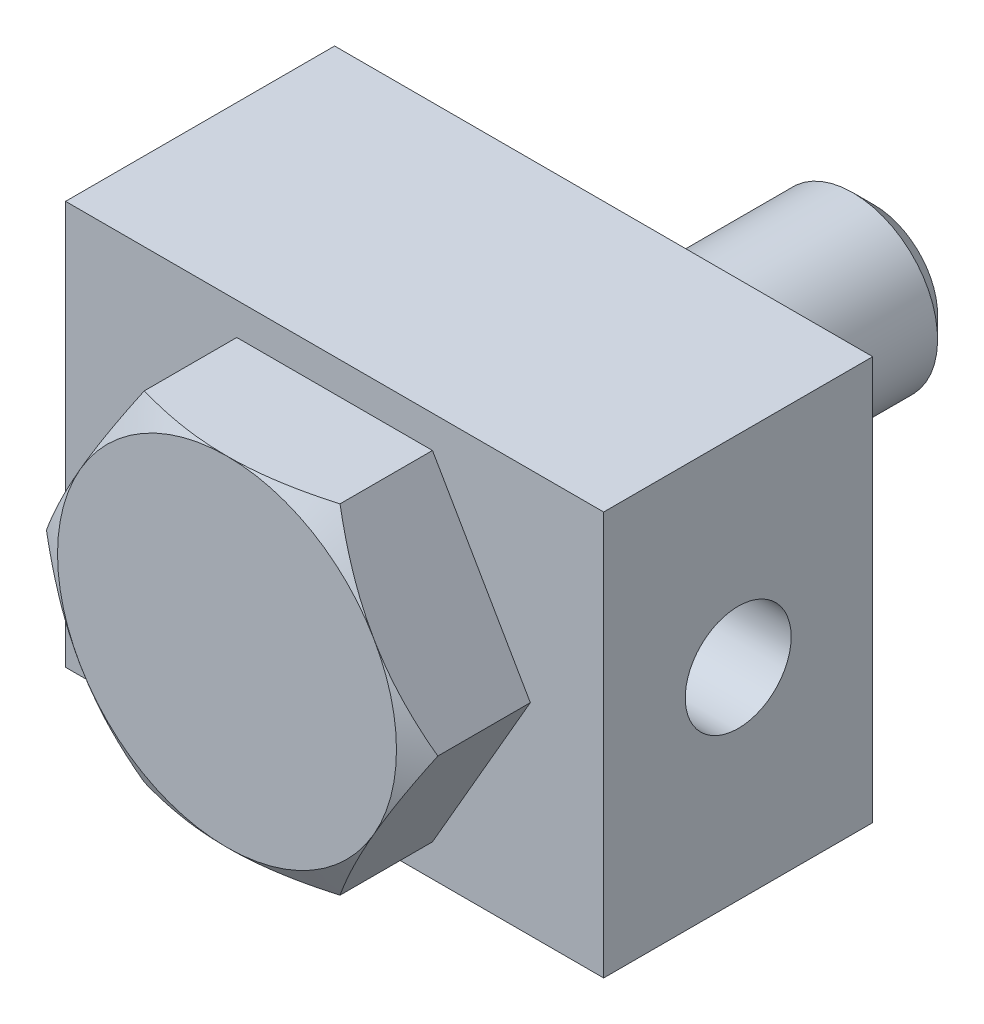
ISO-10303-21;
HEADER;
FILE_DESCRIPTION(('STEP AP214'),'2;1');
FILE_NAME('part.step','',(''),(''),'','','');
FILE_SCHEMA(('AUTOMOTIVE_DESIGN { 1 0 10303 214 1 1 1 1 }'));
ENDSEC;
DATA;
#1=APPLICATION_CONTEXT('core data for automotive mechanical design processes');
#2=APPLICATION_PROTOCOL_DEFINITION('international standard','automotive_design',2000,#1);
#3=PRODUCT_CONTEXT('',#1,'mechanical');
#4=PRODUCT('Part','Part','',(#3));
#5=PRODUCT_RELATED_PRODUCT_CATEGORY('part','',(#4));
#6=PRODUCT_DEFINITION_FORMATION('','',#4);
#7=PRODUCT_DEFINITION_CONTEXT('part definition',#1,'design');
#8=PRODUCT_DEFINITION('design','',#6,#7);
#9=PRODUCT_DEFINITION_SHAPE('','',#8);
#10=(LENGTH_UNIT() NAMED_UNIT(*) SI_UNIT(.MILLI.,.METRE.));
#11=(NAMED_UNIT(*) PLANE_ANGLE_UNIT() SI_UNIT($,.RADIAN.));
#12=(NAMED_UNIT(*) SI_UNIT($,.STERADIAN.) SOLID_ANGLE_UNIT());
#13=UNCERTAINTY_MEASURE_WITH_UNIT(LENGTH_MEASURE(1.E-05),#10,'distance_accuracy_value','');
#14=(GEOMETRIC_REPRESENTATION_CONTEXT(3) GLOBAL_UNCERTAINTY_ASSIGNED_CONTEXT((#13)) GLOBAL_UNIT_ASSIGNED_CONTEXT((#10,
#11,#12)) REPRESENTATION_CONTEXT('',''));
#15=CARTESIAN_POINT('',(0.,0.,0.));
#16=DIRECTION('',(0.,0.,1.));
#17=DIRECTION('',(1.,0.,0.));
#18=AXIS2_PLACEMENT_3D('',#15,#16,#17);
#19=CARTESIAN_POINT('',(25.4,-19.05,26.924));
#20=DIRECTION('',(0.,0.,1.));
#21=DIRECTION('',(0.,1.,0.));
#22=AXIS2_PLACEMENT_3D('',#19,#20,#21);
#23=PLANE('',#22);
#24=DIRECTION('',(0.,-1.,0.));
#25=VECTOR('',#24,1.);
#26=CARTESIAN_POINT('',(-25.4,0.,26.924));
#27=LINE('',#26,#25);
#28=CARTESIAN_POINT('',(-25.4,19.05,26.924));
#29=VERTEX_POINT('',#28);
#30=CARTESIAN_POINT('',(-25.4,-19.05,26.924));
#31=VERTEX_POINT('',#30);
#32=EDGE_CURVE('E295',#29,#31,#27,.T.);
#33=ORIENTED_EDGE('',*,*,#32,.T.);
#34=DIRECTION('',(1.,0.,0.));
#35=VECTOR('',#34,1.);
#36=CARTESIAN_POINT('',(0.,-19.05,26.924));
#37=LINE('',#36,#35);
#38=CARTESIAN_POINT('',(25.4,-19.05,26.924));
#39=VERTEX_POINT('',#38);
#40=EDGE_CURVE('E290',#31,#39,#37,.T.);
#41=ORIENTED_EDGE('',*,*,#40,.T.);
#42=DIRECTION('',(0.,1.,0.));
#43=VECTOR('',#42,1.);
#44=CARTESIAN_POINT('',(25.4,0.,26.924));
#45=LINE('',#44,#43);
#46=CARTESIAN_POINT('',(25.4,19.05,26.924));
#47=VERTEX_POINT('',#46);
#48=EDGE_CURVE('E275',#39,#47,#45,.T.);
#49=ORIENTED_EDGE('',*,*,#48,.T.);
#50=DIRECTION('',(-1.,0.,0.));
#51=VECTOR('',#50,1.);
#52=CARTESIAN_POINT('',(0.,19.05,26.924));
#53=LINE('',#52,#51);
#54=EDGE_CURVE('E300',#47,#29,#53,.T.);
#55=ORIENTED_EDGE('',*,*,#54,.T.);
#56=EDGE_LOOP('',(#33,#41,#49,#55));
#57=FACE_BOUND('',#56,.T.);
#58=DIRECTION('',(-0.5,-0.866025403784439,0.));
#59=VECTOR('',#58,1.);
#60=CARTESIAN_POINT('',(-9.23760430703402,16.,26.924));
#61=LINE('',#60,#59);
#62=CARTESIAN_POINT('',(-9.23760430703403,16.,26.924));
#63=VERTEX_POINT('',#62);
#64=CARTESIAN_POINT('',(-18.475208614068,0.,26.924));
#65=VERTEX_POINT('',#64);
#66=EDGE_CURVE('E495',#63,#65,#61,.T.);
#67=ORIENTED_EDGE('',*,*,#66,.F.);
#68=DIRECTION('',(-1.,0.,0.));
#69=VECTOR('',#68,1.);
#70=CARTESIAN_POINT('',(9.23760430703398,16.,26.924));
#71=LINE('',#70,#69);
#72=CARTESIAN_POINT('',(9.23760430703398,16.,26.924));
#73=VERTEX_POINT('',#72);
#74=EDGE_CURVE('E482',#73,#63,#71,.T.);
#75=ORIENTED_EDGE('',*,*,#74,.F.);
#76=DIRECTION('',(-0.5,0.866025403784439,0.));
#77=VECTOR('',#76,1.);
#78=CARTESIAN_POINT('',(18.475208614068,0.,26.924));
#79=LINE('',#78,#77);
#80=CARTESIAN_POINT('',(18.475208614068,0.,26.924));
#81=VERTEX_POINT('',#80);
#82=EDGE_CURVE('E485',#81,#73,#79,.T.);
#83=ORIENTED_EDGE('',*,*,#82,.F.);
#84=DIRECTION('',(0.5,0.866025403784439,0.));
#85=VECTOR('',#84,1.);
#86=CARTESIAN_POINT('',(9.23760430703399,-16.,26.924));
#87=LINE('',#86,#85);
#88=CARTESIAN_POINT('',(9.23760430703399,-16.,26.924));
#89=VERTEX_POINT('',#88);
#90=EDGE_CURVE('E487',#89,#81,#87,.T.);
#91=ORIENTED_EDGE('',*,*,#90,.F.);
#92=DIRECTION('',(1.,0.,0.));
#93=VECTOR('',#92,1.);
#94=CARTESIAN_POINT('',(-9.23760430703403,-16.,26.924));
#95=LINE('',#94,#93);
#96=CARTESIAN_POINT('',(-9.23760430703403,-16.,26.924));
#97=VERTEX_POINT('',#96);
#98=EDGE_CURVE('E490',#97,#89,#95,.T.);
#99=ORIENTED_EDGE('',*,*,#98,.F.);
#100=DIRECTION('',(0.5,-0.866025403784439,0.));
#101=VECTOR('',#100,1.);
#102=CARTESIAN_POINT('',(-18.475208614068,0.,26.924));
#103=LINE('',#102,#101);
#104=EDGE_CURVE('E493',#65,#97,#103,.T.);
#105=ORIENTED_EDGE('',*,*,#104,.F.);
#106=EDGE_LOOP('',(#67,#75,#83,#91,#99,#105));
#107=FACE_BOUND('',#106,.T.);
#108=ADVANCED_FACE('F14',(#57,#107),#23,.T.);
#109=CARTESIAN_POINT('',(12.788138,-12.788138,0.));
#110=DIRECTION('',(0.,0.,1.));
#111=DIRECTION('',(0.,1.,0.));
#112=AXIS2_PLACEMENT_3D('',#109,#110,#111);
#113=PLANE('',#112);
#114=CARTESIAN_POINT('',(0.,0.,0.));
#115=DIRECTION('',(0.,0.,1.));
#116=DIRECTION('',(1.,0.,0.));
#117=AXIS2_PLACEMENT_3D('',#114,#115,#116);
#118=CIRCLE('',#117,12.6365);
#119=CARTESIAN_POINT('',(12.6365,0.,0.));
#120=VERTEX_POINT('',#119);
#121=EDGE_CURVE('E135',#120,#120,#118,.T.);
#122=ORIENTED_EDGE('',*,*,#121,.F.);
#123=EDGE_LOOP('',(#122));
#124=FACE_BOUND('',#123,.T.);
#125=CARTESIAN_POINT('',(0.,0.,0.));
#126=DIRECTION('',(0.,0.,-1.));
#127=DIRECTION('',(0.,1.,0.));
#128=AXIS2_PLACEMENT_3D('',#125,#126,#127);
#129=CIRCLE('',#128,8.000000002);
#130=CARTESIAN_POINT('',(0.,8.000000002,0.));
#131=VERTEX_POINT('',#130);
#132=EDGE_CURVE('E129',#131,#131,#129,.T.);
#133=ORIENTED_EDGE('',*,*,#132,.F.);
#134=EDGE_LOOP('',(#133));
#135=FACE_BOUND('',#134,.T.);
#136=ADVANCED_FACE('F223',(#124,#135),#113,.F.);
#137=CARTESIAN_POINT('',(0.,0.,0.));
#138=DIRECTION('',(0.,0.,1.));
#139=DIRECTION('',(1.,0.,0.));
#140=AXIS2_PLACEMENT_3D('',#137,#138,#139);
#141=CYLINDRICAL_SURFACE('',#140,12.6365);
#142=CARTESIAN_POINT('',(0.,0.,1.524));
#143=DIRECTION('',(0.,0.,1.));
#144=DIRECTION('',(1.,0.,0.));
#145=AXIS2_PLACEMENT_3D('',#142,#143,#144);
#146=CIRCLE('',#145,12.6365);
#147=CARTESIAN_POINT('',(12.6365,0.,1.524));
#148=VERTEX_POINT('',#147);
#149=EDGE_CURVE('E304',#148,#148,#146,.T.);
#150=ORIENTED_EDGE('',*,*,#149,.F.);
#151=EDGE_LOOP('',(#150));
#152=FACE_BOUND('',#151,.T.);
#153=ORIENTED_EDGE('',*,*,#121,.T.);
#154=EDGE_LOOP('',(#153));
#155=FACE_BOUND('',#154,.T.);
#156=ADVANCED_FACE('F219',(#152,#155),#141,.T.);
#157=CARTESIAN_POINT('',(25.4,-19.05,1.524));
#158=DIRECTION('',(0.,0.,1.));
#159=DIRECTION('',(0.,1.,0.));
#160=AXIS2_PLACEMENT_3D('',#157,#158,#159);
#161=PLANE('',#160);
#162=ORIENTED_EDGE('',*,*,#149,.T.);
#163=EDGE_LOOP('',(#162));
#164=FACE_BOUND('',#163,.T.);
#165=DIRECTION('',(1.,0.,0.));
#166=VECTOR('',#165,1.);
#167=CARTESIAN_POINT('',(0.,-19.05,1.524));
#168=LINE('',#167,#166);
#169=CARTESIAN_POINT('',(-25.4,-19.05,1.524));
#170=VERTEX_POINT('',#169);
#171=CARTESIAN_POINT('',(25.4,-19.05,1.524));
#172=VERTEX_POINT('',#171);
#173=EDGE_CURVE('E468',#170,#172,#168,.T.);
#174=ORIENTED_EDGE('',*,*,#173,.F.);
#175=DIRECTION('',(0.,-1.,0.));
#176=VECTOR('',#175,1.);
#177=CARTESIAN_POINT('',(-25.4,0.,1.524));
#178=LINE('',#177,#176);
#179=CARTESIAN_POINT('',(-25.4,19.05,1.524));
#180=VERTEX_POINT('',#179);
#181=EDGE_CURVE('E282',#180,#170,#178,.T.);
#182=ORIENTED_EDGE('',*,*,#181,.F.);
#183=DIRECTION('',(-1.,0.,0.));
#184=VECTOR('',#183,1.);
#185=CARTESIAN_POINT('',(0.,19.05,1.524));
#186=LINE('',#185,#184);
#187=CARTESIAN_POINT('',(25.4,19.05,1.524));
#188=VERTEX_POINT('',#187);
#189=EDGE_CURVE('E280',#188,#180,#186,.T.);
#190=ORIENTED_EDGE('',*,*,#189,.F.);
#191=DIRECTION('',(0.,1.,0.));
#192=VECTOR('',#191,1.);
#193=CARTESIAN_POINT('',(25.4,0.,1.524));
#194=LINE('',#193,#192);
#195=EDGE_CURVE('E277',#172,#188,#194,.T.);
#196=ORIENTED_EDGE('',*,*,#195,.F.);
#197=EDGE_LOOP('',(#174,#182,#190,#196));
#198=FACE_BOUND('',#197,.T.);
#199=ADVANCED_FACE('F222',(#164,#198),#161,.F.);
#200=CARTESIAN_POINT('',(25.4,-19.05,1.524));
#201=DIRECTION('',(0.,1.,0.));
#202=DIRECTION('',(-1.,0.,0.));
#203=AXIS2_PLACEMENT_3D('',#200,#201,#202);
#204=PLANE('',#203);
#205=DIRECTION('',(0.,0.,1.));
#206=VECTOR('',#205,1.);
#207=CARTESIAN_POINT('',(25.4,-19.05,14.224));
#208=LINE('',#207,#206);
#209=EDGE_CURVE('E284',#172,#39,#208,.T.);
#210=ORIENTED_EDGE('',*,*,#209,.T.);
#211=ORIENTED_EDGE('',*,*,#40,.F.);
#212=DIRECTION('',(0.,0.,1.));
#213=VECTOR('',#212,1.);
#214=CARTESIAN_POINT('',(-25.4,-19.05,14.224));
#215=LINE('',#214,#213);
#216=EDGE_CURVE('E292',#170,#31,#215,.T.);
#217=ORIENTED_EDGE('',*,*,#216,.F.);
#218=ORIENTED_EDGE('',*,*,#173,.T.);
#219=EDGE_LOOP('',(#210,#211,#217,#218));
#220=FACE_BOUND('',#219,.T.);
#221=ADVANCED_FACE('F234',(#220),#204,.F.);
#222=CARTESIAN_POINT('',(-25.4,19.05,1.524));
#223=DIRECTION('',(0.,-1.,0.));
#224=DIRECTION('',(1.,0.,0.));
#225=AXIS2_PLACEMENT_3D('',#222,#223,#224);
#226=PLANE('',#225);
#227=DIRECTION('',(0.,0.,1.));
#228=VECTOR('',#227,1.);
#229=CARTESIAN_POINT('',(-25.4,19.05,14.224));
#230=LINE('',#229,#228);
#231=EDGE_CURVE('E297',#180,#29,#230,.T.);
#232=ORIENTED_EDGE('',*,*,#231,.T.);
#233=ORIENTED_EDGE('',*,*,#54,.F.);
#234=DIRECTION('',(0.,0.,-1.));
#235=VECTOR('',#234,1.);
#236=CARTESIAN_POINT('',(25.4,19.05,14.224));
#237=LINE('',#236,#235);
#238=EDGE_CURVE('E273',#47,#188,#237,.T.);
#239=ORIENTED_EDGE('',*,*,#238,.T.);
#240=ORIENTED_EDGE('',*,*,#189,.T.);
#241=EDGE_LOOP('',(#232,#233,#239,#240));
#242=FACE_BOUND('',#241,.T.);
#243=ADVANCED_FACE('F230',(#242),#226,.F.);
#244=CARTESIAN_POINT('',(25.4,19.05,1.524));
#245=DIRECTION('',(-1.,0.,0.));
#246=DIRECTION('',(0.,-1.,0.));
#247=AXIS2_PLACEMENT_3D('',#244,#245,#246);
#248=PLANE('',#247);
#249=CARTESIAN_POINT('',(25.4,0.,14.224));
#250=DIRECTION('',(1.,0.,0.));
#251=DIRECTION('',(0.,0.,-1.));
#252=AXIS2_PLACEMENT_3D('',#249,#250,#251);
#253=CIRCLE('',#252,5.);
#254=CARTESIAN_POINT('',(25.4,0.,9.224));
#255=VERTEX_POINT('',#254);
#256=EDGE_CURVE('E263',#255,#255,#253,.T.);
#257=ORIENTED_EDGE('',*,*,#256,.F.);
#258=EDGE_LOOP('',(#257));
#259=FACE_BOUND('',#258,.T.);
#260=ORIENTED_EDGE('',*,*,#238,.F.);
#261=ORIENTED_EDGE('',*,*,#48,.F.);
#262=ORIENTED_EDGE('',*,*,#209,.F.);
#263=ORIENTED_EDGE('',*,*,#195,.T.);
#264=EDGE_LOOP('',(#260,#261,#262,#263));
#265=FACE_BOUND('',#264,.T.);
#266=ADVANCED_FACE('F233',(#259,#265),#248,.F.);
#267=CARTESIAN_POINT('',(-25.4,-19.05,1.524));
#268=DIRECTION('',(1.,0.,0.));
#269=DIRECTION('',(0.,1.,0.));
#270=AXIS2_PLACEMENT_3D('',#267,#268,#269);
#271=PLANE('',#270);
#272=CARTESIAN_POINT('',(-25.4,0.,14.224));
#273=DIRECTION('',(1.,0.,0.));
#274=DIRECTION('',(0.,0.,-1.));
#275=AXIS2_PLACEMENT_3D('',#272,#273,#274);
#276=CIRCLE('',#275,5.);
#277=CARTESIAN_POINT('',(-25.4,0.,9.224));
#278=VERTEX_POINT('',#277);
#279=EDGE_CURVE('E260',#278,#278,#276,.T.);
#280=ORIENTED_EDGE('',*,*,#279,.T.);
#281=EDGE_LOOP('',(#280));
#282=FACE_BOUND('',#281,.T.);
#283=ORIENTED_EDGE('',*,*,#216,.T.);
#284=ORIENTED_EDGE('',*,*,#32,.F.);
#285=ORIENTED_EDGE('',*,*,#231,.F.);
#286=ORIENTED_EDGE('',*,*,#181,.T.);
#287=EDGE_LOOP('',(#283,#284,#285,#286));
#288=FACE_BOUND('',#287,.T.);
#289=ADVANCED_FACE('F236',(#282,#288),#271,.F.);
#290=CARTESIAN_POINT('',(9.23760430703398,16.,85.9648074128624));
#291=DIRECTION('',(0.,-1.,0.));
#292=DIRECTION('',(0.,0.,-1.));
#293=AXIS2_PLACEMENT_3D('',#290,#291,#292);
#294=PLANE('',#293);
#295=DIRECTION('',(0.,0.,-1.));
#296=VECTOR('',#295,1.);
#297=CARTESIAN_POINT('',(-9.23760430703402,16.,85.9648074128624));
#298=LINE('',#297,#296);
#299=CARTESIAN_POINT('',(-9.23760430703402,16.,35.6549376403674));
#300=VERTEX_POINT('',#299);
#301=EDGE_CURVE('E480',#300,#63,#298,.T.);
#302=ORIENTED_EDGE('',*,*,#301,.F.);
#303=CARTESIAN_POINT('',(-24.83138834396,16.,29.266811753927));
#304=CARTESIAN_POINT('',(-24.4819198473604,16.,29.436414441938));
#305=CARTESIAN_POINT('',(-24.1320417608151,16.,29.6051727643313));
#306=CARTESIAN_POINT('',(-23.4313809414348,16.,29.9408094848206));
#307=CARTESIAN_POINT('',(-23.0805981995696,16.,30.1076878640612));
#308=CARTESIAN_POINT('',(-22.0266716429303,16.,30.6052601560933));
#309=CARTESIAN_POINT('',(-21.3220525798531,16.,30.9328410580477));
#310=CARTESIAN_POINT('',(-19.9042792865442,16.,31.5794839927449));
#311=CARTESIAN_POINT('',(-19.1910994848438,16.,31.8984900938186));
#312=CARTESIAN_POINT('',(-17.7590747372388,16.,32.5234772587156));
#313=CARTESIAN_POINT('',(-17.0402300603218,16.,32.8294589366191));
#314=CARTESIAN_POINT('',(-15.5724285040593,16.,33.4345582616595));
#315=CARTESIAN_POINT('',(-14.8232480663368,16.,33.7331364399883));
#316=CARTESIAN_POINT('',(-13.3161235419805,16.,34.3077400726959));
#317=CARTESIAN_POINT('',(-12.5581784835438,16.,34.5837629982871));
#318=CARTESIAN_POINT('',(-11.033756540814,16.,35.1060188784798));
#319=CARTESIAN_POINT('',(-10.2673004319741,16.,35.3523119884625));
#320=CARTESIAN_POINT('',(-8.72332088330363,16.,35.8072307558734));
#321=CARTESIAN_POINT('',(-7.94580100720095,16.,36.0158682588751));
#322=CARTESIAN_POINT('',(-6.77324538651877,16.,36.2924693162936));
#323=CARTESIAN_POINT('',(-6.38242804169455,16.,36.3784240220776));
#324=CARTESIAN_POINT('',(-5.59811954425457,16.,36.5371937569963));
#325=CARTESIAN_POINT('',(-5.20462844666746,16.,36.6100090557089));
#326=CARTESIAN_POINT('',(-4.4152412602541,16.,36.7412159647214));
#327=CARTESIAN_POINT('',(-4.01934519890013,16.,36.7996077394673));
#328=CARTESIAN_POINT('',(-3.22556907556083,16.,36.9008029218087));
#329=CARTESIAN_POINT('',(-2.82768909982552,16.,36.9436070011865));
#330=CARTESIAN_POINT('',(-2.03570081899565,16.,37.012239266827));
#331=CARTESIAN_POINT('',(-1.6416112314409,16.,37.0382821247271));
#332=CARTESIAN_POINT('',(-0.852684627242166,16.,37.0736779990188));
#333=CARTESIAN_POINT('',(-0.457847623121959,16.,37.083031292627));
#334=CARTESIAN_POINT('',(0.331869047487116,16.,37.0848255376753));
#335=CARTESIAN_POINT('',(0.726748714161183,16.,37.0772664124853));
#336=CARTESIAN_POINT('',(1.51583717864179,16.,37.0454203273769));
#337=CARTESIAN_POINT('',(1.91004594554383,16.,37.0211326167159));
#338=CARTESIAN_POINT('',(2.85691899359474,16.,36.9432187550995));
#339=CARTESIAN_POINT('',(3.40894408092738,16.,36.8816851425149));
#340=CARTESIAN_POINT('',(4.50891237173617,16.,36.7291611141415));
#341=CARTESIAN_POINT('',(5.05685501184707,16.,36.6381667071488));
#342=CARTESIAN_POINT('',(6.14813145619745,16.,36.4299580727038));
#343=CARTESIAN_POINT('',(6.69146132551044,16.,36.3127234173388));
#344=CARTESIAN_POINT('',(7.77267795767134,16.,36.0556130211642));
#345=CARTESIAN_POINT('',(8.31056480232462,16.,35.9157376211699));
#346=CARTESIAN_POINT('',(9.3927044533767,16.,35.6134501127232));
#347=CARTESIAN_POINT('',(9.93683679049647,16.,35.4506097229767));
#348=CARTESIAN_POINT('',(11.0197415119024,16.,35.1080781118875));
#349=CARTESIAN_POINT('',(11.5585138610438,16.,34.928386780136));
#350=CARTESIAN_POINT('',(12.6309641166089,16.,34.5550086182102));
#351=CARTESIAN_POINT('',(13.1646436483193,16.,34.3613264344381));
#352=CARTESIAN_POINT('',(14.2275791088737,16.,33.9622476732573));
#353=CARTESIAN_POINT('',(14.7568350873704,16.,33.7568512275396));
#354=CARTESIAN_POINT('',(15.996738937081,16.,33.2623830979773));
#355=CARTESIAN_POINT('',(16.7057730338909,16.,32.9692711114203));
#356=CARTESIAN_POINT('',(18.1178685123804,16.,32.3689562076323));
#357=CARTESIAN_POINT('',(18.8209295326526,16.,32.0617524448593));
#358=CARTESIAN_POINT('',(20.2221780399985,16.,31.4360491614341));
#359=CARTESIAN_POINT('',(20.9203644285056,16.,31.1175471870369));
#360=CARTESIAN_POINT('',(22.3125151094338,16.,30.4715051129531));
#361=CARTESIAN_POINT('',(23.0064794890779,16.,30.1439652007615));
#362=CARTESIAN_POINT('',(24.3916247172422,16.,29.4811661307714));
#363=CARTESIAN_POINT('',(25.0828017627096,16.,29.1458990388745));
#364=CARTESIAN_POINT('',(26.4621788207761,16.,28.46929686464));
#365=CARTESIAN_POINT('',(27.1503788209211,16.,28.127961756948));
#366=CARTESIAN_POINT('',(28.5241687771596,16.,27.4402991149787));
#367=CARTESIAN_POINT('',(29.2097590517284,16.,27.0939722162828));
#368=CARTESIAN_POINT('',(30.5787906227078,16.,26.397094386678));
#369=CARTESIAN_POINT('',(31.2622319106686,16.,26.0465434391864));
#370=CARTESIAN_POINT('',(33.196631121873,16.,25.0479826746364));
#371=CARTESIAN_POINT('',(34.4454209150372,16.,24.3957728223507));
#372=CARTESIAN_POINT('',(36.9383302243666,16.,23.0824053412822));
#373=CARTESIAN_POINT('',(38.1824495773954,16.,22.4212474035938));
#374=CARTESIAN_POINT('',(40.6639602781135,16.,21.0937061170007));
#375=CARTESIAN_POINT('',(41.9013606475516,16.,20.4273396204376));
#376=CARTESIAN_POINT('',(43.7552534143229,16.,19.4237961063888));
#377=CARTESIAN_POINT('',(44.3728332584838,16.,19.0886249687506));
#378=CARTESIAN_POINT('',(45.6073397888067,16.,18.4170841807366));
#379=CARTESIAN_POINT('',(46.2242664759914,16.,18.0807145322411));
#380=CARTESIAN_POINT('',(46.8409034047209,16.,17.7438143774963));
#381=B_SPLINE_CURVE_WITH_KNOTS('',3,(#303,#304,#305,#306,#307,#308,#309,#310,#311,#312,#313,
#314,#315,#316,#317,#318,#319,#320,#321,#322,#323,#324,#325,#326,#327,#328,#329,#330,#331,#332,
#333,#334,#335,#336,#337,#338,#339,#340,#341,#342,#343,#344,#345,#346,#347,#348,#349,#350,#351,
#352,#353,#354,#355,#356,#357,#358,#359,#360,#361,#362,#363,#364,#365,#366,#367,#368,#369,#370,
#371,#372,#373,#374,#375,#376,#377,#378,#379,#380),.UNSPECIFIED.,.F.,.F.,(4,2,2,2,2,2,2,2,2,2,2,
2,2,2,2,2,2,2,2,2,2,2,2,2,2,2,2,2,2,2,2,2,2,2,2,2,2,2,4),(0.,1.16534750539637,2.33070668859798,
4.66176895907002,7.0054918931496,9.34910420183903,11.768286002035,14.1877386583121,
16.6022106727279,19.0159218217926,20.2162106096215,21.4164747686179,22.6167252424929,
23.8169239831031,25.0014278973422,26.1859121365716,27.3704017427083,28.5549445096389,
30.2203554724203,31.8859921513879,33.5529300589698,35.2198428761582,36.9234454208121,
38.6270591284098,40.3301096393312,42.0331410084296,44.334629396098,46.6362560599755,
48.9383856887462,51.2404675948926,53.545028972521,55.8495999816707,58.1538801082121,
60.4581692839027,64.6846594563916,68.9112959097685,73.1275364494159,75.2355442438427,
77.3435487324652),.UNSPECIFIED.);
#382=CARTESIAN_POINT('',(0.,16.,37.084));
#383=VERTEX_POINT('',#382);
#384=EDGE_CURVE('E33',#300,#383,#381,.T.);
#385=ORIENTED_EDGE('',*,*,#384,.T.);
#386=CARTESIAN_POINT('',(9.23760430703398,16.,35.6549376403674));
#387=VERTEX_POINT('',#386);
#388=EDGE_CURVE('E126',#383,#387,#381,.T.);
#389=ORIENTED_EDGE('',*,*,#388,.T.);
#390=DIRECTION('',(0.,0.,-1.));
#391=VECTOR('',#390,1.);
#392=CARTESIAN_POINT('',(9.23760430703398,16.,85.9648074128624));
#393=LINE('',#392,#391);
#394=EDGE_CURVE('E140',#387,#73,#393,.T.);
#395=ORIENTED_EDGE('',*,*,#394,.T.);
#396=ORIENTED_EDGE('',*,*,#74,.T.);
#397=EDGE_LOOP('',(#302,#385,#389,#395,#396));
#398=FACE_BOUND('',#397,.T.);
#399=ADVANCED_FACE('F170',(#398),#294,.F.);
#400=CARTESIAN_POINT('',(18.475208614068,0.,85.9648074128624));
#401=DIRECTION('',(-0.866025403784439,-0.5,0.));
#402=DIRECTION('',(0.5,-0.866025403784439,0.));
#403=AXIS2_PLACEMENT_3D('',#400,#401,#402);
#404=PLANE('',#403);
#405=ORIENTED_EDGE('',*,*,#394,.F.);
#406=CARTESIAN_POINT('',(9.23748883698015,16.0002,35.6548709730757));
#407=CARTESIAN_POINT('',(9.44052768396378,15.6485264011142,35.7720876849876));
#408=CARTESIAN_POINT('',(9.64435849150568,15.2954810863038,35.8839853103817));
#409=CARTESIAN_POINT('',(10.0536545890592,14.5865594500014,36.0956638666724));
#410=CARTESIAN_POINT('',(10.2591203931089,14.2306822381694,36.1954408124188));
#411=CARTESIAN_POINT('',(10.6720835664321,13.5154090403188,36.3815367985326));
#412=CARTESIAN_POINT('',(10.8795845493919,13.1560067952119,36.4678239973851));
#413=CARTESIAN_POINT('',(11.296028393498,12.4347048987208,36.62508765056));
#414=CARTESIAN_POINT('',(11.5049711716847,12.0728053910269,36.6960649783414));
#415=CARTESIAN_POINT('',(11.918944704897,11.3557821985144,36.8196899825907));
#416=CARTESIAN_POINT('',(12.123944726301,11.00071174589,36.8727468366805));
#417=CARTESIAN_POINT('',(12.5348841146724,10.2889438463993,36.9617113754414));
#418=CARTESIAN_POINT('',(12.7408234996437,9.9322463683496,36.9976187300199));
#419=CARTESIAN_POINT('',(13.1530482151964,9.21825221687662,37.0513776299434));
#420=CARTESIAN_POINT('',(13.3593328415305,8.86095676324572,37.0692506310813));
#421=CARTESIAN_POINT('',(13.7720925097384,8.14603604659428,37.0865564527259));
#422=CARTESIAN_POINT('',(13.9785675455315,7.78841079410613,37.0859898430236));
#423=CARTESIAN_POINT('',(14.3645705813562,7.11983392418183,37.0677045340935));
#424=CARTESIAN_POINT('',(14.5441260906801,6.80883465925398,37.0522162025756));
#425=CARTESIAN_POINT('',(14.902824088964,6.18755150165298,37.0075864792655));
#426=CARTESIAN_POINT('',(15.0819665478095,5.87726766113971,36.9784441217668));
#427=CARTESIAN_POINT('',(15.4397411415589,5.25758388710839,36.9070144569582));
#428=CARTESIAN_POINT('',(15.6183727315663,4.94818489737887,36.8647162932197));
#429=CARTESIAN_POINT('',(15.9747984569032,4.33083743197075,36.7677171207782));
#430=CARTESIAN_POINT('',(16.1525925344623,4.02288905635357,36.7130152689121));
#431=CARTESIAN_POINT('',(16.6922962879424,3.08809473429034,36.5289213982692));
#432=CARTESIAN_POINT('',(17.0526430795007,2.46395578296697,36.3811733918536));
#433=CARTESIAN_POINT('',(17.7679634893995,1.22498448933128,36.0458459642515));
#434=CARTESIAN_POINT('',(18.1229462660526,0.610136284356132,35.8583452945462));
#435=CARTESIAN_POINT('',(18.4753240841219,-0.000199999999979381,35.6548709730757));
#436=B_SPLINE_CURVE_WITH_KNOTS('',3,(#406,#407,#408,#409,#410,#411,#412,#413,#414,#415,#416,
#417,#418,#419,#420,#421,#422,#423,#424,#425,#426,#427,#428,#429,#430,#431,#432,#433,#434,#435),
.UNSPECIFIED.,.F.,.F.,(4,2,2,2,2,2,2,2,2,2,2,2,2,2,4),(0.,1.26800386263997,2.53642350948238,
3.80779337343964,5.07909068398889,6.31900943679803,7.55895205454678,8.79741774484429,
10.0358451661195,11.1139198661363,12.1920708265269,13.2711138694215,14.350230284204,
16.5559177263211,18.7572757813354),.UNSPECIFIED.);
#437=CARTESIAN_POINT('',(13.856406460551,8.,37.084));
#438=VERTEX_POINT('',#437);
#439=EDGE_CURVE('E119',#387,#438,#436,.T.);
#440=ORIENTED_EDGE('',*,*,#439,.T.);
#441=CARTESIAN_POINT('',(18.475208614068,0.,35.6549376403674));
#442=VERTEX_POINT('',#441);
#443=EDGE_CURVE('E108',#438,#442,#436,.T.);
#444=ORIENTED_EDGE('',*,*,#443,.T.);
#445=DIRECTION('',(0.,0.,-1.));
#446=VECTOR('',#445,1.);
#447=CARTESIAN_POINT('',(18.475208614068,0.,85.9648074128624));
#448=LINE('',#447,#446);
#449=EDGE_CURVE('E477',#442,#81,#448,.T.);
#450=ORIENTED_EDGE('',*,*,#449,.T.);
#451=ORIENTED_EDGE('',*,*,#82,.T.);
#452=EDGE_LOOP('',(#405,#440,#444,#450,#451));
#453=FACE_BOUND('',#452,.T.);
#454=ADVANCED_FACE('F138',(#453),#404,.F.);
#455=CARTESIAN_POINT('',(9.23760430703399,-16.,85.9648074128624));
#456=DIRECTION('',(-0.866025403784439,0.5,0.));
#457=DIRECTION('',(-0.5,-0.866025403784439,0.));
#458=AXIS2_PLACEMENT_3D('',#455,#456,#457);
#459=PLANE('',#458);
#460=ORIENTED_EDGE('',*,*,#449,.F.);
#461=CARTESIAN_POINT('',(18.4753240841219,0.000200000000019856,35.6548709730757));
#462=CARTESIAN_POINT('',(18.2722852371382,-0.35147359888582,35.7720876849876));
#463=CARTESIAN_POINT('',(18.0684544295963,-0.70451891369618,35.8839853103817));
#464=CARTESIAN_POINT('',(17.6591583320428,-1.41344054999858,36.0956638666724));
#465=CARTESIAN_POINT('',(17.4536925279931,-1.7693177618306,36.1954408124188));
#466=CARTESIAN_POINT('',(17.0407293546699,-2.4845909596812,36.3815367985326));
#467=CARTESIAN_POINT('',(16.8332283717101,-2.84399320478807,36.4678239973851));
#468=CARTESIAN_POINT('',(16.416784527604,-3.56529510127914,36.62508765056));
#469=CARTESIAN_POINT('',(16.2078417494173,-3.92719460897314,36.6960649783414));
#470=CARTESIAN_POINT('',(15.793868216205,-4.64421780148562,36.8196899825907));
#471=CARTESIAN_POINT('',(15.588868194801,-4.99928825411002,36.8727468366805));
#472=CARTESIAN_POINT('',(15.1779288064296,-5.71105615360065,36.9617113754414));
#473=CARTESIAN_POINT('',(14.9719894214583,-6.0677536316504,36.9976187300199));
#474=CARTESIAN_POINT('',(14.5597647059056,-6.78174778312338,37.0513776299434));
#475=CARTESIAN_POINT('',(14.3534800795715,-7.13904323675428,37.0692506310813));
#476=CARTESIAN_POINT('',(13.9407204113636,-7.85396395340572,37.0865564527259));
#477=CARTESIAN_POINT('',(13.7342453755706,-8.21158920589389,37.0859898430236));
#478=CARTESIAN_POINT('',(13.3482423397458,-8.88016607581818,37.0677045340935));
#479=CARTESIAN_POINT('',(13.1686868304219,-9.19116534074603,37.0522162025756));
#480=CARTESIAN_POINT('',(12.809988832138,-9.81244849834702,37.0075864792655));
#481=CARTESIAN_POINT('',(12.6308463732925,-10.1227323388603,36.9784441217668));
#482=CARTESIAN_POINT('',(12.2730717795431,-10.7424161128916,36.9070144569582));
#483=CARTESIAN_POINT('',(12.0944401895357,-11.0518151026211,36.8647162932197));
#484=CARTESIAN_POINT('',(11.7380144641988,-11.6691625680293,36.7677171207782));
#485=CARTESIAN_POINT('',(11.5602203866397,-11.9771109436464,36.7130152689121));
#486=CARTESIAN_POINT('',(11.0205166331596,-12.9119052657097,36.5289213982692));
#487=CARTESIAN_POINT('',(10.6601698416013,-13.536044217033,36.3811733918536));
#488=CARTESIAN_POINT('',(9.94484943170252,-14.7750155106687,36.0458459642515));
#489=CARTESIAN_POINT('',(9.58986665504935,-15.3898637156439,35.8583452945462));
#490=CARTESIAN_POINT('',(9.23748883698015,-16.0002,35.6548709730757));
#491=B_SPLINE_CURVE_WITH_KNOTS('',3,(#461,#462,#463,#464,#465,#466,#467,#468,#469,#470,#471,
#472,#473,#474,#475,#476,#477,#478,#479,#480,#481,#482,#483,#484,#485,#486,#487,#488,#489,#490),
.UNSPECIFIED.,.F.,.F.,(4,2,2,2,2,2,2,2,2,2,2,2,2,2,4),(0.,1.26800386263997,2.53642350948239,
3.80779337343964,5.0790906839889,6.31900943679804,7.5589520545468,8.79741774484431,
10.0358451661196,11.1139198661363,12.1920708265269,13.2711138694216,14.350230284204,
16.5559177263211,18.7572757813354),.UNSPECIFIED.);
#492=CARTESIAN_POINT('',(13.856406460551,-8.,37.084));
#493=VERTEX_POINT('',#492);
#494=EDGE_CURVE('E115',#442,#493,#491,.T.);
#495=ORIENTED_EDGE('',*,*,#494,.T.);
#496=CARTESIAN_POINT('',(9.23760430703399,-16.,35.6549376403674));
#497=VERTEX_POINT('',#496);
#498=EDGE_CURVE('E149',#493,#497,#491,.T.);
#499=ORIENTED_EDGE('',*,*,#498,.T.);
#500=DIRECTION('',(0.,0.,-1.));
#501=VECTOR('',#500,1.);
#502=CARTESIAN_POINT('',(9.23760430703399,-16.,85.9648074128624));
#503=LINE('',#502,#501);
#504=EDGE_CURVE('E475',#497,#89,#503,.T.);
#505=ORIENTED_EDGE('',*,*,#504,.T.);
#506=ORIENTED_EDGE('',*,*,#90,.T.);
#507=EDGE_LOOP('',(#460,#495,#499,#505,#506));
#508=FACE_BOUND('',#507,.T.);
#509=ADVANCED_FACE('F203',(#508),#459,.F.);
#510=CARTESIAN_POINT('',(-9.23760430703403,-16.,85.9648074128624));
#511=DIRECTION('',(0.,1.,0.));
#512=DIRECTION('',(0.,0.,1.));
#513=AXIS2_PLACEMENT_3D('',#510,#511,#512);
#514=PLANE('',#513);
#515=ORIENTED_EDGE('',*,*,#504,.F.);
#516=CARTESIAN_POINT('',(-24.83138834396,-16.,29.2668117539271));
#517=CARTESIAN_POINT('',(-24.4819198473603,-16.,29.436414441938));
#518=CARTESIAN_POINT('',(-24.1320417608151,-16.,29.6051727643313));
#519=CARTESIAN_POINT('',(-23.4313809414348,-16.,29.9408094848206));
#520=CARTESIAN_POINT('',(-23.0805981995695,-16.,30.1076878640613));
#521=CARTESIAN_POINT('',(-22.0266716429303,-16.,30.6052601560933));
#522=CARTESIAN_POINT('',(-21.3220525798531,-16.,30.9328410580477));
#523=CARTESIAN_POINT('',(-19.9042792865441,-16.,31.5794839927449));
#524=CARTESIAN_POINT('',(-19.1910994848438,-16.,31.8984900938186));
#525=CARTESIAN_POINT('',(-17.7590747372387,-16.,32.5234772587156));
#526=CARTESIAN_POINT('',(-17.0402300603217,-16.,32.8294589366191));
#527=CARTESIAN_POINT('',(-15.5724285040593,-16.,33.4345582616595));
#528=CARTESIAN_POINT('',(-14.8232480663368,-16.,33.7331364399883));
#529=CARTESIAN_POINT('',(-13.3161235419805,-16.,34.3077400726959));
#530=CARTESIAN_POINT('',(-12.5581784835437,-16.,34.5837629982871));
#531=CARTESIAN_POINT('',(-11.033756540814,-16.,35.1060188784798));
#532=CARTESIAN_POINT('',(-10.2673004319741,-16.,35.3523119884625));
#533=CARTESIAN_POINT('',(-8.72332088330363,-16.,35.8072307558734));
#534=CARTESIAN_POINT('',(-7.94580100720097,-16.,36.0158682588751));
#535=CARTESIAN_POINT('',(-6.77324538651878,-16.,36.2924693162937));
#536=CARTESIAN_POINT('',(-6.38242804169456,-16.,36.3784240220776));
#537=CARTESIAN_POINT('',(-5.59811954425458,-16.,36.5371937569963));
#538=CARTESIAN_POINT('',(-5.20462844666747,-16.,36.6100090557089));
#539=CARTESIAN_POINT('',(-4.41524126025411,-16.,36.7412159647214));
#540=CARTESIAN_POINT('',(-4.01934519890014,-16.,36.7996077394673));
#541=CARTESIAN_POINT('',(-3.22556907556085,-16.,36.9008029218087));
#542=CARTESIAN_POINT('',(-2.82768909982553,-16.,36.9436070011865));
#543=CARTESIAN_POINT('',(-2.03570081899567,-16.,37.012239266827));
#544=CARTESIAN_POINT('',(-1.64161123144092,-16.,37.0382821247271));
#545=CARTESIAN_POINT('',(-0.85268462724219,-16.,37.0736779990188));
#546=CARTESIAN_POINT('',(-0.457847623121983,-16.,37.083031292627));
#547=CARTESIAN_POINT('',(0.331869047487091,-16.,37.0848255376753));
#548=CARTESIAN_POINT('',(0.726748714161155,-16.,37.0772664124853));
#549=CARTESIAN_POINT('',(1.51583717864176,-16.,37.0454203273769));
#550=CARTESIAN_POINT('',(1.9100459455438,-16.,37.0211326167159));
#551=CARTESIAN_POINT('',(2.85691899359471,-16.,36.9432187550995));
#552=CARTESIAN_POINT('',(3.40894408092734,-16.,36.8816851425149));
#553=CARTESIAN_POINT('',(4.50891237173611,-16.,36.7291611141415));
#554=CARTESIAN_POINT('',(5.05685501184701,-16.,36.6381667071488));
#555=CARTESIAN_POINT('',(6.14813145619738,-16.,36.4299580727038));
#556=CARTESIAN_POINT('',(6.69146132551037,-16.,36.3127234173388));
#557=CARTESIAN_POINT('',(7.77267795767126,-16.,36.0556130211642));
#558=CARTESIAN_POINT('',(8.31056480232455,-16.,35.9157376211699));
#559=CARTESIAN_POINT('',(9.39270445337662,-16.,35.6134501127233));
#560=CARTESIAN_POINT('',(9.93683679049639,-16.,35.4506097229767));
#561=CARTESIAN_POINT('',(11.0197415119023,-16.,35.1080781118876));
#562=CARTESIAN_POINT('',(11.5585138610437,-16.,34.928386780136));
#563=CARTESIAN_POINT('',(12.6309641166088,-16.,34.5550086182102));
#564=CARTESIAN_POINT('',(13.1646436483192,-16.,34.3613264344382));
#565=CARTESIAN_POINT('',(14.2275791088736,-16.,33.9622476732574));
#566=CARTESIAN_POINT('',(14.7568350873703,-16.,33.7568512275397));
#567=CARTESIAN_POINT('',(15.9967389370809,-16.,33.2623830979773));
#568=CARTESIAN_POINT('',(16.7057730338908,-16.,32.9692711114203));
#569=CARTESIAN_POINT('',(18.1178685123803,-16.,32.3689562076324));
#570=CARTESIAN_POINT('',(18.8209295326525,-16.,32.0617524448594));
#571=CARTESIAN_POINT('',(20.2221780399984,-16.,31.4360491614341));
#572=CARTESIAN_POINT('',(20.9203644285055,-16.,31.117547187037));
#573=CARTESIAN_POINT('',(22.3125151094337,-16.,30.4715051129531));
#574=CARTESIAN_POINT('',(23.0064794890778,-16.,30.1439652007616));
#575=CARTESIAN_POINT('',(24.3916247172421,-16.,29.4811661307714));
#576=CARTESIAN_POINT('',(25.0828017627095,-16.,29.1458990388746));
#577=CARTESIAN_POINT('',(26.462178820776,-16.,28.46929686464));
#578=CARTESIAN_POINT('',(27.150378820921,-16.,28.127961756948));
#579=CARTESIAN_POINT('',(28.5241687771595,-16.,27.4402991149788));
#580=CARTESIAN_POINT('',(29.2097590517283,-16.,27.0939722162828));
#581=CARTESIAN_POINT('',(30.5787906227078,-16.,26.3970943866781));
#582=CARTESIAN_POINT('',(31.2622319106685,-16.,26.0465434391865));
#583=CARTESIAN_POINT('',(33.196631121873,-16.,25.0479826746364));
#584=CARTESIAN_POINT('',(34.4454209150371,-16.,24.3957728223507));
#585=CARTESIAN_POINT('',(36.9383302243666,-16.,23.0824053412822));
#586=CARTESIAN_POINT('',(38.1824495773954,-16.,22.4212474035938));
#587=CARTESIAN_POINT('',(40.6639602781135,-16.,21.0937061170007));
#588=CARTESIAN_POINT('',(41.9013606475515,-16.,20.4273396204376));
#589=CARTESIAN_POINT('',(43.7552534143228,-16.,19.4237961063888));
#590=CARTESIAN_POINT('',(44.3728332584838,-16.,19.0886249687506));
#591=CARTESIAN_POINT('',(45.6073397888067,-16.,18.4170841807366));
#592=CARTESIAN_POINT('',(46.2242664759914,-16.,18.0807145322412));
#593=CARTESIAN_POINT('',(46.8409034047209,-16.,17.7438143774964));
#594=B_SPLINE_CURVE_WITH_KNOTS('',3,(#516,#517,#518,#519,#520,#521,#522,#523,#524,#525,#526,
#527,#528,#529,#530,#531,#532,#533,#534,#535,#536,#537,#538,#539,#540,#541,#542,#543,#544,#545,
#546,#547,#548,#549,#550,#551,#552,#553,#554,#555,#556,#557,#558,#559,#560,#561,#562,#563,#564,
#565,#566,#567,#568,#569,#570,#571,#572,#573,#574,#575,#576,#577,#578,#579,#580,#581,#582,#583,
#584,#585,#586,#587,#588,#589,#590,#591,#592,#593),.UNSPECIFIED.,.F.,.F.,(4,2,2,2,2,2,2,2,2,2,2,
2,2,2,2,2,2,2,2,2,2,2,2,2,2,2,2,2,2,2,2,2,2,2,2,2,2,2,4),(0.,1.16534750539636,2.33070668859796,
4.66176895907,7.00549189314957,9.34910420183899,11.7682860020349,14.187738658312,
16.6022106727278,19.0159218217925,20.2162106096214,21.4164747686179,22.6167252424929,
23.816923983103,25.0014278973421,26.1859121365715,27.3704017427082,28.5549445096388,
30.2203554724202,31.8859921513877,33.5529300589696,35.219842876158,36.923445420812,
38.6270591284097,40.3301096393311,42.0331410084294,44.3346293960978,46.6362560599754,
48.938385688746,51.2404675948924,53.5450289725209,55.8495999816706,58.153880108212,
60.4581692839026,64.6846594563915,68.9112959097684,73.1275364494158,75.2355442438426,
77.3435487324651),.UNSPECIFIED.);
#595=CARTESIAN_POINT('',(0.,-16.,37.084));
#596=VERTEX_POINT('',#595);
#597=EDGE_CURVE('E197',#497,#596,#594,.F.);
#598=ORIENTED_EDGE('',*,*,#597,.T.);
#599=CARTESIAN_POINT('',(-9.23760430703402,-16.,35.6549376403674));
#600=VERTEX_POINT('',#599);
#601=EDGE_CURVE('E190',#596,#600,#594,.F.);
#602=ORIENTED_EDGE('',*,*,#601,.T.);
#603=DIRECTION('',(0.,0.,-1.));
#604=VECTOR('',#603,1.);
#605=CARTESIAN_POINT('',(-9.23760430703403,-16.,85.9648074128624));
#606=LINE('',#605,#604);
#607=EDGE_CURVE('E473',#600,#97,#606,.T.);
#608=ORIENTED_EDGE('',*,*,#607,.T.);
#609=ORIENTED_EDGE('',*,*,#98,.T.);
#610=EDGE_LOOP('',(#515,#598,#602,#608,#609));
#611=FACE_BOUND('',#610,.T.);
#612=ADVANCED_FACE('F199',(#611),#514,.F.);
#613=CARTESIAN_POINT('',(-18.475208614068,0.,85.9648074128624));
#614=DIRECTION('',(0.866025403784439,0.5,0.));
#615=DIRECTION('',(-0.5,0.866025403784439,0.));
#616=AXIS2_PLACEMENT_3D('',#613,#614,#615);
#617=PLANE('',#616);
#618=ORIENTED_EDGE('',*,*,#607,.F.);
#619=CARTESIAN_POINT('',(-9.23748883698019,-16.0002,35.6548709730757));
#620=CARTESIAN_POINT('',(-9.44052768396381,-15.6485264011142,35.7720876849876));
#621=CARTESIAN_POINT('',(-9.64435849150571,-15.2954810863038,35.8839853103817));
#622=CARTESIAN_POINT('',(-10.0536545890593,-14.5865594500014,36.0956638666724));
#623=CARTESIAN_POINT('',(-10.2591203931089,-14.2306822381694,36.1954408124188));
#624=CARTESIAN_POINT('',(-10.6720835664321,-13.5154090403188,36.3815367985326));
#625=CARTESIAN_POINT('',(-10.8795845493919,-13.1560067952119,36.4678239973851));
#626=CARTESIAN_POINT('',(-11.296028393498,-12.4347048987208,36.62508765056));
#627=CARTESIAN_POINT('',(-11.5049711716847,-12.0728053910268,36.6960649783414));
#628=CARTESIAN_POINT('',(-11.918944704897,-11.3557821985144,36.8196899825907));
#629=CARTESIAN_POINT('',(-12.123944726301,-11.00071174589,36.8727468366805));
#630=CARTESIAN_POINT('',(-12.5348841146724,-10.2889438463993,36.9617113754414));
#631=CARTESIAN_POINT('',(-12.7408234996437,-9.93224636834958,36.9976187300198));
#632=CARTESIAN_POINT('',(-13.1530482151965,-9.21825221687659,37.0513776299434));
#633=CARTESIAN_POINT('',(-13.3593328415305,-8.86095676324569,37.0692506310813));
#634=CARTESIAN_POINT('',(-13.7720925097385,-8.14603604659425,37.0865564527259));
#635=CARTESIAN_POINT('',(-13.9785675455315,-7.78841079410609,37.0859898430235));
#636=CARTESIAN_POINT('',(-14.3645705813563,-7.11983392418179,37.0677045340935));
#637=CARTESIAN_POINT('',(-14.5441260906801,-6.80883465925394,37.0522162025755));
#638=CARTESIAN_POINT('',(-14.902824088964,-6.18755150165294,37.0075864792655));
#639=CARTESIAN_POINT('',(-15.0819665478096,-5.87726766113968,36.9784441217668));
#640=CARTESIAN_POINT('',(-15.439741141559,-5.25758388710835,36.9070144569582));
#641=CARTESIAN_POINT('',(-15.6183727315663,-4.94818489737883,36.8647162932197));
#642=CARTESIAN_POINT('',(-15.9747984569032,-4.33083743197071,36.7677171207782));
#643=CARTESIAN_POINT('',(-16.1525925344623,-4.02288905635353,36.7130152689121));
#644=CARTESIAN_POINT('',(-16.6922962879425,-3.0880947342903,36.5289213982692));
#645=CARTESIAN_POINT('',(-17.0526430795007,-2.46395578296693,36.3811733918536));
#646=CARTESIAN_POINT('',(-17.7679634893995,-1.22498448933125,36.0458459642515));
#647=CARTESIAN_POINT('',(-18.1229462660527,-0.610136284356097,35.8583452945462));
#648=CARTESIAN_POINT('',(-18.4753240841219,0.000200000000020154,35.6548709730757));
#649=B_SPLINE_CURVE_WITH_KNOTS('',3,(#619,#620,#621,#622,#623,#624,#625,#626,#627,#628,#629,
#630,#631,#632,#633,#634,#635,#636,#637,#638,#639,#640,#641,#642,#643,#644,#645,#646,#647,#648),
.UNSPECIFIED.,.F.,.F.,(4,2,2,2,2,2,2,2,2,2,2,2,2,2,4),(0.,1.26800386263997,2.53642350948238,
3.80779337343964,5.0790906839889,6.31900943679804,7.5589520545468,8.79741774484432,
10.0358451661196,11.1139198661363,12.1920708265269,13.2711138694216,14.350230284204,
16.5559177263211,18.7572757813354),.UNSPECIFIED.);
#650=CARTESIAN_POINT('',(-13.856406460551,-8.,37.084));
#651=VERTEX_POINT('',#650);
#652=EDGE_CURVE('E198',#600,#651,#649,.T.);
#653=ORIENTED_EDGE('',*,*,#652,.T.);
#654=CARTESIAN_POINT('',(-18.475208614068,0.,35.6549376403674));
#655=VERTEX_POINT('',#654);
#656=EDGE_CURVE('E183',#651,#655,#649,.T.);
#657=ORIENTED_EDGE('',*,*,#656,.T.);
#658=DIRECTION('',(0.,0.,-1.));
#659=VECTOR('',#658,1.);
#660=CARTESIAN_POINT('',(-18.475208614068,0.,85.9648074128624));
#661=LINE('',#660,#659);
#662=EDGE_CURVE('E302',#655,#65,#661,.T.);
#663=ORIENTED_EDGE('',*,*,#662,.T.);
#664=ORIENTED_EDGE('',*,*,#104,.T.);
#665=EDGE_LOOP('',(#618,#653,#657,#663,#664));
#666=FACE_BOUND('',#665,.T.);
#667=ADVANCED_FACE('F202',(#666),#617,.F.);
#668=CARTESIAN_POINT('',(-9.23760430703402,16.,85.9648074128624));
#669=DIRECTION('',(0.866025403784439,-0.5,0.));
#670=DIRECTION('',(0.5,0.866025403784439,0.));
#671=AXIS2_PLACEMENT_3D('',#668,#669,#670);
#672=PLANE('',#671);
#673=ORIENTED_EDGE('',*,*,#662,.F.);
#674=CARTESIAN_POINT('',(-18.4753240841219,-0.000199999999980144,35.6548709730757));
#675=CARTESIAN_POINT('',(-18.2722852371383,0.35147359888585,35.7720876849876));
#676=CARTESIAN_POINT('',(-18.0684544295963,0.704518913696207,35.8839853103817));
#677=CARTESIAN_POINT('',(-17.6591583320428,1.41344054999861,36.0956638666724));
#678=CARTESIAN_POINT('',(-17.4536925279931,1.76931776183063,36.1954408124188));
#679=CARTESIAN_POINT('',(-17.04072935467,2.48459095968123,36.3815367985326));
#680=CARTESIAN_POINT('',(-16.8332283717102,2.8439932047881,36.4678239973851));
#681=CARTESIAN_POINT('',(-16.416784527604,3.56529510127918,36.62508765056));
#682=CARTESIAN_POINT('',(-16.2078417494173,3.92719460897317,36.6960649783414));
#683=CARTESIAN_POINT('',(-15.793868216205,4.64421780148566,36.8196899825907));
#684=CARTESIAN_POINT('',(-15.5888681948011,4.99928825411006,36.8727468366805));
#685=CARTESIAN_POINT('',(-15.1779288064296,5.71105615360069,36.9617113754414));
#686=CARTESIAN_POINT('',(-14.9719894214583,6.06775363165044,36.9976187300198));
#687=CARTESIAN_POINT('',(-14.5597647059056,6.78174778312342,37.0513776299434));
#688=CARTESIAN_POINT('',(-14.3534800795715,7.13904323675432,37.0692506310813));
#689=CARTESIAN_POINT('',(-13.9407204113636,7.85396395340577,37.0865564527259));
#690=CARTESIAN_POINT('',(-13.7342453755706,8.21158920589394,37.0859898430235));
#691=CARTESIAN_POINT('',(-13.3482423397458,8.88016607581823,37.0677045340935));
#692=CARTESIAN_POINT('',(-13.1686868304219,9.19116534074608,37.0522162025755));
#693=CARTESIAN_POINT('',(-12.809988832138,9.81244849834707,37.0075864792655));
#694=CARTESIAN_POINT('',(-12.6308463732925,10.1227323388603,36.9784441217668));
#695=CARTESIAN_POINT('',(-12.2730717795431,10.7424161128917,36.9070144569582));
#696=CARTESIAN_POINT('',(-12.0944401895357,11.0518151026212,36.8647162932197));
#697=CARTESIAN_POINT('',(-11.7380144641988,11.6691625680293,36.7677171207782));
#698=CARTESIAN_POINT('',(-11.5602203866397,11.9771109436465,36.7130152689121));
#699=CARTESIAN_POINT('',(-11.0205166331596,12.9119052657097,36.5289213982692));
#700=CARTESIAN_POINT('',(-10.6601698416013,13.5360442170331,36.3811733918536));
#701=CARTESIAN_POINT('',(-9.94484943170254,14.7750155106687,36.0458459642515));
#702=CARTESIAN_POINT('',(-9.58986665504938,15.3898637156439,35.8583452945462));
#703=CARTESIAN_POINT('',(-9.23748883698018,16.0002,35.6548709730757));
#704=B_SPLINE_CURVE_WITH_KNOTS('',3,(#674,#675,#676,#677,#678,#679,#680,#681,#682,#683,#684,
#685,#686,#687,#688,#689,#690,#691,#692,#693,#694,#695,#696,#697,#698,#699,#700,#701,#702,#703),
.UNSPECIFIED.,.F.,.F.,(4,2,2,2,2,2,2,2,2,2,2,2,2,2,4),(0.,1.26800386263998,2.5364235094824,
3.80779337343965,5.07909068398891,6.31900943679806,7.55895205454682,8.79741774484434,
10.0358451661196,11.1139198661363,12.1920708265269,13.2711138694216,14.350230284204,
16.5559177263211,18.7572757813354),.UNSPECIFIED.);
#705=CARTESIAN_POINT('',(-13.856406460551,8.,37.084));
#706=VERTEX_POINT('',#705);
#707=EDGE_CURVE('E503',#655,#706,#704,.T.);
#708=ORIENTED_EDGE('',*,*,#707,.T.);
#709=EDGE_CURVE('E128',#706,#300,#704,.T.);
#710=ORIENTED_EDGE('',*,*,#709,.T.);
#711=ORIENTED_EDGE('',*,*,#301,.T.);
#712=ORIENTED_EDGE('',*,*,#66,.T.);
#713=EDGE_LOOP('',(#673,#708,#710,#711,#712));
#714=FACE_BOUND('',#713,.T.);
#715=ADVANCED_FACE('F208',(#714),#672,.F.);
#716=CARTESIAN_POINT('',(0.,0.,33.2731769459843));
#717=DIRECTION('',(0.,0.,-1.));
#718=DIRECTION('',(-1.,0.,0.));
#719=AXIS2_PLACEMENT_3D('',#716,#717,#718);
#720=CONICAL_SURFACE('',#719,22.60053914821,1.0471975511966);
#721=CARTESIAN_POINT('',(0.,0.,37.084));
#722=DIRECTION('',(0.,0.,1.));
#723=DIRECTION('',(1.,0.,0.));
#724=AXIS2_PLACEMENT_3D('',#721,#722,#723);
#725=CIRCLE('',#724,16.);
#726=EDGE_CURVE('E123',#438,#383,#725,.T.);
#727=ORIENTED_EDGE('',*,*,#726,.F.);
#728=ORIENTED_EDGE('',*,*,#439,.F.);
#729=ORIENTED_EDGE('',*,*,#388,.F.);
#730=EDGE_LOOP('',(#727,#728,#729));
#731=FACE_BOUND('',#730,.T.);
#732=ADVANCED_FACE('F124',(#731),#720,.T.);
#733=CARTESIAN_POINT('',(0.,0.,37.084));
#734=DIRECTION('',(0.,0.,-1.));
#735=DIRECTION('',(0.,1.,0.));
#736=AXIS2_PLACEMENT_3D('',#733,#734,#735);
#737=CIRCLE('',#736,16.);
#738=EDGE_CURVE('E112',#493,#438,#737,.F.);
#739=ORIENTED_EDGE('',*,*,#738,.F.);
#740=ORIENTED_EDGE('',*,*,#494,.F.);
#741=ORIENTED_EDGE('',*,*,#443,.F.);
#742=EDGE_LOOP('',(#739,#740,#741));
#743=FACE_BOUND('',#742,.T.);
#744=ADVANCED_FACE('F110',(#743),#720,.T.);
#745=EDGE_CURVE('E134',#596,#493,#737,.F.);
#746=ORIENTED_EDGE('',*,*,#745,.F.);
#747=ORIENTED_EDGE('',*,*,#597,.F.);
#748=ORIENTED_EDGE('',*,*,#498,.F.);
#749=EDGE_LOOP('',(#746,#747,#748));
#750=FACE_BOUND('',#749,.T.);
#751=ADVANCED_FACE('F352',(#750),#720,.T.);
#752=EDGE_CURVE('E509',#651,#596,#737,.F.);
#753=ORIENTED_EDGE('',*,*,#752,.F.);
#754=ORIENTED_EDGE('',*,*,#652,.F.);
#755=ORIENTED_EDGE('',*,*,#601,.F.);
#756=EDGE_LOOP('',(#753,#754,#755));
#757=FACE_BOUND('',#756,.T.);
#758=ADVANCED_FACE('F344',(#757),#720,.T.);
#759=EDGE_CURVE('E306',#706,#651,#737,.F.);
#760=ORIENTED_EDGE('',*,*,#759,.F.);
#761=ORIENTED_EDGE('',*,*,#707,.F.);
#762=ORIENTED_EDGE('',*,*,#656,.F.);
#763=EDGE_LOOP('',(#760,#761,#762));
#764=FACE_BOUND('',#763,.T.);
#765=ADVANCED_FACE('F167',(#764),#720,.T.);
#766=ORIENTED_EDGE('',*,*,#709,.F.);
#767=EDGE_CURVE('E29',#383,#706,#737,.F.);
#768=ORIENTED_EDGE('',*,*,#767,.F.);
#769=ORIENTED_EDGE('',*,*,#384,.F.);
#770=EDGE_LOOP('',(#766,#768,#769));
#771=FACE_BOUND('',#770,.T.);
#772=ADVANCED_FACE('F163',(#771),#720,.T.);
#773=CARTESIAN_POINT('',(16.0655,16.0655,37.084));
#774=DIRECTION('',(0.,0.,-1.));
#775=DIRECTION('',(0.,-1.,0.));
#776=AXIS2_PLACEMENT_3D('',#773,#774,#775);
#777=PLANE('',#776);
#778=ORIENTED_EDGE('',*,*,#726,.T.);
#779=ORIENTED_EDGE('',*,*,#767,.T.);
#780=ORIENTED_EDGE('',*,*,#759,.T.);
#781=ORIENTED_EDGE('',*,*,#752,.T.);
#782=ORIENTED_EDGE('',*,*,#745,.T.);
#783=ORIENTED_EDGE('',*,*,#738,.T.);
#784=EDGE_LOOP('',(#778,#779,#780,#781,#782,#783));
#785=FACE_BOUND('',#784,.T.);
#786=ADVANCED_FACE('F131',(#785),#777,.F.);
#787=CARTESIAN_POINT('',(0.,0.,-24.));
#788=DIRECTION('',(0.,0.,-1.));
#789=DIRECTION('',(0.,1.,0.));
#790=AXIS2_PLACEMENT_3D('',#787,#788,#789);
#791=PLANE('',#790);
#792=CARTESIAN_POINT('',(0.,0.,-24.));
#793=DIRECTION('',(0.,0.,-1.));
#794=DIRECTION('',(0.,1.,0.));
#795=AXIS2_PLACEMENT_3D('',#792,#793,#794);
#796=CIRCLE('',#795,6.00000000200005);
#797=CARTESIAN_POINT('',(0.,6.00000000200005,-24.));
#798=VERTEX_POINT('',#797);
#799=EDGE_CURVE('E22',#798,#798,#796,.T.);
#800=ORIENTED_EDGE('',*,*,#799,.T.);
#801=EDGE_LOOP('',(#800));
#802=FACE_BOUND('',#801,.T.);
#803=ADVANCED_FACE('F168',(#802),#791,.T.);
#804=CARTESIAN_POINT('',(0.,0.,-24.));
#805=DIRECTION('',(0.,0.,1.));
#806=DIRECTION('',(0.,-1.,0.));
#807=AXIS2_PLACEMENT_3D('',#804,#805,#806);
#808=CONICAL_SURFACE('',#807,6.00000000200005,0.785398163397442);
#809=CARTESIAN_POINT('',(0.,0.,-22.));
#810=DIRECTION('',(0.,0.,-1.));
#811=DIRECTION('',(0.,1.,0.));
#812=AXIS2_PLACEMENT_3D('',#809,#810,#811);
#813=CIRCLE('',#812,8.000000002);
#814=CARTESIAN_POINT('',(0.,8.000000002,-22.));
#815=VERTEX_POINT('',#814);
#816=EDGE_CURVE('E9',#815,#815,#813,.F.);
#817=ORIENTED_EDGE('',*,*,#816,.F.);
#818=EDGE_LOOP('',(#817));
#819=FACE_BOUND('',#818,.T.);
#820=ORIENTED_EDGE('',*,*,#799,.F.);
#821=EDGE_LOOP('',(#820));
#822=FACE_BOUND('',#821,.T.);
#823=ADVANCED_FACE('F16',(#819,#822),#808,.T.);
#824=CARTESIAN_POINT('',(0.,0.,-22.606));
#825=DIRECTION('',(0.,0.,1.));
#826=DIRECTION('',(0.,1.,0.));
#827=AXIS2_PLACEMENT_3D('',#824,#825,#826);
#828=CYLINDRICAL_SURFACE('',#827,8.000000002);
#829=ORIENTED_EDGE('',*,*,#816,.T.);
#830=EDGE_LOOP('',(#829));
#831=FACE_BOUND('',#830,.T.);
#832=ORIENTED_EDGE('',*,*,#132,.T.);
#833=EDGE_LOOP('',(#832));
#834=FACE_BOUND('',#833,.T.);
#835=ADVANCED_FACE('F214',(#831,#834),#828,.T.);
#836=CARTESIAN_POINT('',(-25.4,0.,14.224));
#837=DIRECTION('',(1.,0.,0.));
#838=DIRECTION('',(0.,0.,-1.));
#839=AXIS2_PLACEMENT_3D('',#836,#837,#838);
#840=CYLINDRICAL_SURFACE('',#839,5.);
#841=ORIENTED_EDGE('',*,*,#279,.F.);
#842=EDGE_LOOP('',(#841));
#843=FACE_BOUND('',#842,.T.);
#844=ORIENTED_EDGE('',*,*,#256,.T.);
#845=EDGE_LOOP('',(#844));
#846=FACE_BOUND('',#845,.T.);
#847=ADVANCED_FACE('F217',(#843,#846),#840,.F.);
#848=CLOSED_SHELL('',(#108,#136,#156,#199,#221,#243,#266,#289,#399,#454,#509,#612,#667,#715,
#732,#744,#751,#758,#765,#772,#786,#803,#823,#835,#847));
#849=MANIFOLD_SOLID_BREP('B1',#848);
#850=ADVANCED_BREP_SHAPE_REPRESENTATION('',(#18,#849),#14);
#851=SHAPE_DEFINITION_REPRESENTATION(#9,#850);
ENDSEC;
END-ISO-10303-21;
